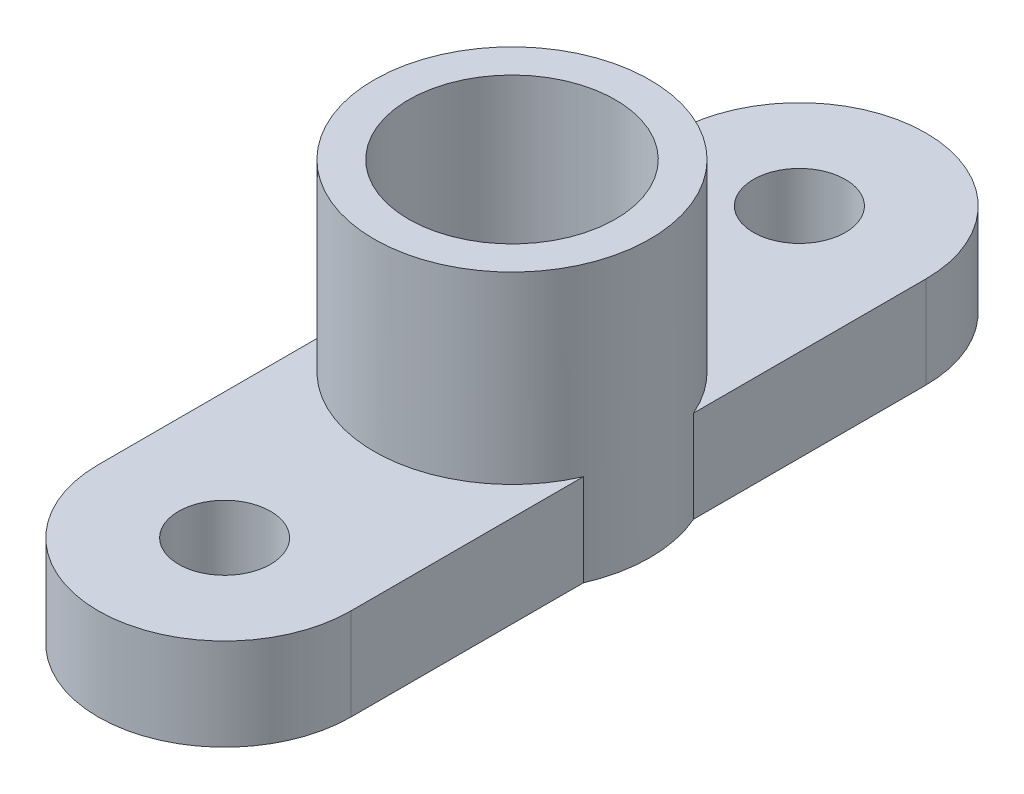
ISO-10303-21;
HEADER;
FILE_DESCRIPTION(('STEP AP214'),'2;1');
FILE_NAME('part.step','',(''),(''),'','','');
FILE_SCHEMA(('AUTOMOTIVE_DESIGN { 1 0 10303 214 1 1 1 1 }'));
ENDSEC;
DATA;
#1=APPLICATION_CONTEXT('core data for automotive mechanical design processes');
#2=APPLICATION_PROTOCOL_DEFINITION('international standard','automotive_design',2000,#1);
#3=PRODUCT_CONTEXT('',#1,'mechanical');
#4=PRODUCT('Part','Part','',(#3));
#5=PRODUCT_RELATED_PRODUCT_CATEGORY('part','',(#4));
#6=PRODUCT_DEFINITION_FORMATION('','',#4);
#7=PRODUCT_DEFINITION_CONTEXT('part definition',#1,'design');
#8=PRODUCT_DEFINITION('design','',#6,#7);
#9=PRODUCT_DEFINITION_SHAPE('','',#8);
#10=(LENGTH_UNIT() NAMED_UNIT(*) SI_UNIT(.MILLI.,.METRE.));
#11=(NAMED_UNIT(*) PLANE_ANGLE_UNIT() SI_UNIT($,.RADIAN.));
#12=(NAMED_UNIT(*) SI_UNIT($,.STERADIAN.) SOLID_ANGLE_UNIT());
#13=UNCERTAINTY_MEASURE_WITH_UNIT(LENGTH_MEASURE(1.E-05),#10,'distance_accuracy_value','');
#14=(GEOMETRIC_REPRESENTATION_CONTEXT(3) GLOBAL_UNCERTAINTY_ASSIGNED_CONTEXT((#13)) GLOBAL_UNIT_ASSIGNED_CONTEXT((#10,
#11,#12)) REPRESENTATION_CONTEXT('',''));
#15=CARTESIAN_POINT('',(0.,0.,0.));
#16=DIRECTION('',(0.,0.,1.));
#17=DIRECTION('',(1.,0.,0.));
#18=AXIS2_PLACEMENT_3D('',#15,#16,#17);
#19=CARTESIAN_POINT('',(-11.,-8.,-25.));
#20=DIRECTION('',(1.,0.,0.));
#21=DIRECTION('',(0.,0.,-1.));
#22=AXIS2_PLACEMENT_3D('',#19,#20,#21);
#23=PLANE('',#22);
#24=DIRECTION('',(0.,1.,0.));
#25=VECTOR('',#24,1.);
#26=CARTESIAN_POINT('',(-11.,-8.,-4.79583152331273));
#27=LINE('',#26,#25);
#28=CARTESIAN_POINT('',(-11.,0.,-4.79583152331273));
#29=VERTEX_POINT('',#28);
#30=CARTESIAN_POINT('',(-11.,-8.,-4.79583152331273));
#31=VERTEX_POINT('',#30);
#32=EDGE_CURVE('E488',#29,#31,#27,.F.);
#33=ORIENTED_EDGE('',*,*,#32,.F.);
#34=DIRECTION('',(0.,0.,-1.));
#35=VECTOR('',#34,1.);
#36=CARTESIAN_POINT('',(-11.,0.,-25.));
#37=LINE('',#36,#35);
#38=CARTESIAN_POINT('',(-11.,0.,-25.));
#39=VERTEX_POINT('',#38);
#40=EDGE_CURVE('E432',#29,#39,#37,.T.);
#41=ORIENTED_EDGE('',*,*,#40,.T.);
#42=DIRECTION('',(0.,1.,0.));
#43=VECTOR('',#42,1.);
#44=CARTESIAN_POINT('',(-11.,-8.,-25.));
#45=LINE('',#44,#43);
#46=CARTESIAN_POINT('',(-11.,-8.,-25.));
#47=VERTEX_POINT('',#46);
#48=EDGE_CURVE('E447',#47,#39,#45,.T.);
#49=ORIENTED_EDGE('',*,*,#48,.F.);
#50=DIRECTION('',(0.,0.,-1.));
#51=VECTOR('',#50,1.);
#52=CARTESIAN_POINT('',(-11.,-8.,-25.));
#53=LINE('',#52,#51);
#54=EDGE_CURVE('E364',#31,#47,#53,.T.);
#55=ORIENTED_EDGE('',*,*,#54,.F.);
#56=EDGE_LOOP('',(#33,#41,#49,#55));
#57=FACE_BOUND('',#56,.T.);
#58=ADVANCED_FACE('F349',(#57),#23,.F.);
#59=DIRECTION('',(0.,1.,0.));
#60=VECTOR('',#59,1.);
#61=CARTESIAN_POINT('',(-11.,-8.,4.79583152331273));
#62=LINE('',#61,#60);
#63=CARTESIAN_POINT('',(-11.,-8.,4.79583152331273));
#64=VERTEX_POINT('',#63);
#65=CARTESIAN_POINT('',(-11.,0.,4.79583152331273));
#66=VERTEX_POINT('',#65);
#67=EDGE_CURVE('E372',#64,#66,#62,.T.);
#68=ORIENTED_EDGE('',*,*,#67,.F.);
#69=CARTESIAN_POINT('',(-11.,-8.,25.));
#70=VERTEX_POINT('',#69);
#71=EDGE_CURVE('E459',#70,#64,#53,.T.);
#72=ORIENTED_EDGE('',*,*,#71,.F.);
#73=DIRECTION('',(0.,1.,0.));
#74=VECTOR('',#73,1.);
#75=CARTESIAN_POINT('',(-11.,-8.,25.));
#76=LINE('',#75,#74);
#77=CARTESIAN_POINT('',(-11.,0.,25.));
#78=VERTEX_POINT('',#77);
#79=EDGE_CURVE('E444',#70,#78,#76,.T.);
#80=ORIENTED_EDGE('',*,*,#79,.T.);
#81=EDGE_CURVE('E465',#78,#66,#37,.T.);
#82=ORIENTED_EDGE('',*,*,#81,.T.);
#83=EDGE_LOOP('',(#68,#72,#80,#82));
#84=FACE_BOUND('',#83,.T.);
#85=ADVANCED_FACE('F517',(#84),#23,.F.);
#86=CARTESIAN_POINT('',(11.,-8.,25.));
#87=DIRECTION('',(-1.,0.,0.));
#88=DIRECTION('',(0.,0.,1.));
#89=AXIS2_PLACEMENT_3D('',#86,#87,#88);
#90=PLANE('',#89);
#91=DIRECTION('',(0.,1.,0.));
#92=VECTOR('',#91,1.);
#93=CARTESIAN_POINT('',(11.,-8.,4.79583152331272));
#94=LINE('',#93,#92);
#95=CARTESIAN_POINT('',(11.,0.,4.79583152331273));
#96=VERTEX_POINT('',#95);
#97=CARTESIAN_POINT('',(11.,-8.,4.79583152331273));
#98=VERTEX_POINT('',#97);
#99=EDGE_CURVE('E11',#96,#98,#94,.F.);
#100=ORIENTED_EDGE('',*,*,#99,.F.);
#101=DIRECTION('',(0.,0.,1.));
#102=VECTOR('',#101,1.);
#103=CARTESIAN_POINT('',(11.,0.,25.));
#104=LINE('',#103,#102);
#105=CARTESIAN_POINT('',(11.,0.,25.));
#106=VERTEX_POINT('',#105);
#107=EDGE_CURVE('E425',#96,#106,#104,.T.);
#108=ORIENTED_EDGE('',*,*,#107,.T.);
#109=DIRECTION('',(0.,1.,0.));
#110=VECTOR('',#109,1.);
#111=CARTESIAN_POINT('',(11.,-8.,25.));
#112=LINE('',#111,#110);
#113=CARTESIAN_POINT('',(11.,-8.,25.));
#114=VERTEX_POINT('',#113);
#115=EDGE_CURVE('E451',#114,#106,#112,.T.);
#116=ORIENTED_EDGE('',*,*,#115,.F.);
#117=DIRECTION('',(0.,0.,1.));
#118=VECTOR('',#117,1.);
#119=CARTESIAN_POINT('',(11.,-8.,25.));
#120=LINE('',#119,#118);
#121=EDGE_CURVE('E456',#98,#114,#120,.T.);
#122=ORIENTED_EDGE('',*,*,#121,.F.);
#123=EDGE_LOOP('',(#100,#108,#116,#122));
#124=FACE_BOUND('',#123,.T.);
#125=ADVANCED_FACE('F522',(#124),#90,.F.);
#126=DIRECTION('',(0.,1.,0.));
#127=VECTOR('',#126,1.);
#128=CARTESIAN_POINT('',(11.,-8.,-4.79583152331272));
#129=LINE('',#128,#127);
#130=CARTESIAN_POINT('',(11.,-8.,-4.79583152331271));
#131=VERTEX_POINT('',#130);
#132=CARTESIAN_POINT('',(11.,0.,-4.79583152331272));
#133=VERTEX_POINT('',#132);
#134=EDGE_CURVE('E357',#131,#133,#129,.T.);
#135=ORIENTED_EDGE('',*,*,#134,.F.);
#136=CARTESIAN_POINT('',(11.,-8.,-25.));
#137=VERTEX_POINT('',#136);
#138=EDGE_CURVE('E454',#137,#131,#120,.T.);
#139=ORIENTED_EDGE('',*,*,#138,.F.);
#140=DIRECTION('',(0.,1.,0.));
#141=VECTOR('',#140,1.);
#142=CARTESIAN_POINT('',(11.,-8.,-25.));
#143=LINE('',#142,#141);
#144=CARTESIAN_POINT('',(11.,0.,-25.));
#145=VERTEX_POINT('',#144);
#146=EDGE_CURVE('E421',#137,#145,#143,.T.);
#147=ORIENTED_EDGE('',*,*,#146,.T.);
#148=EDGE_CURVE('E414',#145,#133,#104,.T.);
#149=ORIENTED_EDGE('',*,*,#148,.T.);
#150=EDGE_LOOP('',(#135,#139,#147,#149));
#151=FACE_BOUND('',#150,.T.);
#152=ADVANCED_FACE('F416',(#151),#90,.F.);
#153=CARTESIAN_POINT('',(0.,16.,0.));
#154=DIRECTION('',(0.,-1.,0.));
#155=DIRECTION('',(0.,0.,-1.));
#156=AXIS2_PLACEMENT_3D('',#153,#154,#155);
#157=CYLINDRICAL_SURFACE('',#156,12.);
#158=CARTESIAN_POINT('',(0.,16.,0.));
#159=DIRECTION('',(0.,1.,0.));
#160=DIRECTION('',(0.,0.,1.));
#161=AXIS2_PLACEMENT_3D('',#158,#159,#160);
#162=CIRCLE('',#161,12.);
#163=CARTESIAN_POINT('',(0.,16.,12.));
#164=VERTEX_POINT('',#163);
#165=EDGE_CURVE('E434',#164,#164,#162,.T.);
#166=ORIENTED_EDGE('',*,*,#165,.F.);
#167=EDGE_LOOP('',(#166));
#168=FACE_BOUND('',#167,.T.);
#169=CARTESIAN_POINT('',(0.,0.,0.));
#170=DIRECTION('',(0.,1.,0.));
#171=DIRECTION('',(0.,0.,1.));
#172=AXIS2_PLACEMENT_3D('',#169,#170,#171);
#173=CIRCLE('',#172,12.);
#174=EDGE_CURVE('E435',#66,#96,#173,.T.);
#175=ORIENTED_EDGE('',*,*,#174,.T.);
#176=ORIENTED_EDGE('',*,*,#99,.T.);
#177=CARTESIAN_POINT('',(0.,-8.,0.));
#178=DIRECTION('',(0.,-1.,0.));
#179=DIRECTION('',(0.,0.,-1.));
#180=AXIS2_PLACEMENT_3D('',#177,#178,#179);
#181=CIRCLE('',#180,12.);
#182=EDGE_CURVE('E440',#131,#98,#181,.T.);
#183=ORIENTED_EDGE('',*,*,#182,.F.);
#184=ORIENTED_EDGE('',*,*,#134,.T.);
#185=EDGE_CURVE('E429',#133,#29,#173,.T.);
#186=ORIENTED_EDGE('',*,*,#185,.T.);
#187=ORIENTED_EDGE('',*,*,#32,.T.);
#188=EDGE_CURVE('E491',#64,#31,#181,.T.);
#189=ORIENTED_EDGE('',*,*,#188,.F.);
#190=ORIENTED_EDGE('',*,*,#67,.T.);
#191=EDGE_LOOP('',(#175,#176,#183,#184,#186,#187,#189,#190));
#192=FACE_BOUND('',#191,.T.);
#193=ADVANCED_FACE('F351',(#168,#192),#157,.T.);
#194=CARTESIAN_POINT('',(0.,16.,0.));
#195=DIRECTION('',(0.,1.,0.));
#196=DIRECTION('',(0.,0.,1.));
#197=AXIS2_PLACEMENT_3D('',#194,#195,#196);
#198=PLANE('',#197);
#199=CARTESIAN_POINT('',(0.,16.,0.));
#200=DIRECTION('',(0.,1.,0.));
#201=DIRECTION('',(0.,0.,1.));
#202=AXIS2_PLACEMENT_3D('',#199,#200,#201);
#203=CIRCLE('',#202,9.);
#204=CARTESIAN_POINT('',(0.,16.,9.));
#205=VERTEX_POINT('',#204);
#206=EDGE_CURVE('E485',#205,#205,#203,.T.);
#207=ORIENTED_EDGE('',*,*,#206,.F.);
#208=EDGE_LOOP('',(#207));
#209=FACE_BOUND('',#208,.T.);
#210=ORIENTED_EDGE('',*,*,#165,.T.);
#211=EDGE_LOOP('',(#210));
#212=FACE_BOUND('',#211,.T.);
#213=ADVANCED_FACE('F523',(#209,#212),#198,.T.);
#214=CARTESIAN_POINT('',(0.,0.,25.));
#215=DIRECTION('',(0.,-1.,0.));
#216=DIRECTION('',(0.,0.,-1.));
#217=AXIS2_PLACEMENT_3D('',#214,#215,#216);
#218=PLANE('',#217);
#219=ORIENTED_EDGE('',*,*,#185,.F.);
#220=ORIENTED_EDGE('',*,*,#148,.F.);
#221=CARTESIAN_POINT('',(0.,0.,-25.));
#222=DIRECTION('',(0.,-1.,0.));
#223=DIRECTION('',(0.,0.,-1.));
#224=AXIS2_PLACEMENT_3D('',#221,#222,#223);
#225=CIRCLE('',#224,11.);
#226=EDGE_CURVE('E463',#39,#145,#225,.T.);
#227=ORIENTED_EDGE('',*,*,#226,.F.);
#228=ORIENTED_EDGE('',*,*,#40,.F.);
#229=EDGE_LOOP('',(#219,#220,#227,#228));
#230=FACE_BOUND('',#229,.T.);
#231=CARTESIAN_POINT('',(0.,0.,-25.));
#232=DIRECTION('',(0.,-1.,0.));
#233=DIRECTION('',(0.,0.,-1.));
#234=AXIS2_PLACEMENT_3D('',#231,#232,#233);
#235=CIRCLE('',#234,4.);
#236=CARTESIAN_POINT('',(0.,0.,-29.));
#237=VERTEX_POINT('',#236);
#238=EDGE_CURVE('E473',#237,#237,#235,.T.);
#239=ORIENTED_EDGE('',*,*,#238,.T.);
#240=EDGE_LOOP('',(#239));
#241=FACE_BOUND('',#240,.T.);
#242=ADVANCED_FACE('F430',(#230,#241),#218,.F.);
#243=CARTESIAN_POINT('',(0.,-8.,25.));
#244=DIRECTION('',(0.,-1.,0.));
#245=DIRECTION('',(0.,0.,-1.));
#246=AXIS2_PLACEMENT_3D('',#243,#244,#245);
#247=PLANE('',#246);
#248=ORIENTED_EDGE('',*,*,#182,.T.);
#249=ORIENTED_EDGE('',*,*,#121,.T.);
#250=CARTESIAN_POINT('',(0.,-8.,25.));
#251=DIRECTION('',(0.,-1.,0.));
#252=DIRECTION('',(0.,0.,-1.));
#253=AXIS2_PLACEMENT_3D('',#250,#251,#252);
#254=CIRCLE('',#253,11.);
#255=EDGE_CURVE('E424',#114,#70,#254,.T.);
#256=ORIENTED_EDGE('',*,*,#255,.T.);
#257=ORIENTED_EDGE('',*,*,#71,.T.);
#258=ORIENTED_EDGE('',*,*,#188,.T.);
#259=ORIENTED_EDGE('',*,*,#54,.T.);
#260=CARTESIAN_POINT('',(0.,-8.,-25.));
#261=DIRECTION('',(0.,-1.,0.));
#262=DIRECTION('',(0.,0.,-1.));
#263=AXIS2_PLACEMENT_3D('',#260,#261,#262);
#264=CIRCLE('',#263,11.);
#265=EDGE_CURVE('E457',#47,#137,#264,.T.);
#266=ORIENTED_EDGE('',*,*,#265,.T.);
#267=ORIENTED_EDGE('',*,*,#138,.T.);
#268=EDGE_LOOP('',(#248,#249,#256,#257,#258,#259,#266,#267));
#269=FACE_BOUND('',#268,.T.);
#270=CARTESIAN_POINT('',(0.,-8.,0.));
#271=DIRECTION('',(0.,1.,0.));
#272=DIRECTION('',(0.,0.,1.));
#273=AXIS2_PLACEMENT_3D('',#270,#271,#272);
#274=CIRCLE('',#273,9.);
#275=CARTESIAN_POINT('',(0.,-8.,9.));
#276=VERTEX_POINT('',#275);
#277=EDGE_CURVE('E482',#276,#276,#274,.T.);
#278=ORIENTED_EDGE('',*,*,#277,.T.);
#279=EDGE_LOOP('',(#278));
#280=FACE_BOUND('',#279,.T.);
#281=CARTESIAN_POINT('',(0.,-8.,-25.));
#282=DIRECTION('',(0.,-1.,0.));
#283=DIRECTION('',(0.,0.,-1.));
#284=AXIS2_PLACEMENT_3D('',#281,#282,#283);
#285=CIRCLE('',#284,4.);
#286=CARTESIAN_POINT('',(0.,-8.,-29.));
#287=VERTEX_POINT('',#286);
#288=EDGE_CURVE('E470',#287,#287,#285,.T.);
#289=ORIENTED_EDGE('',*,*,#288,.F.);
#290=EDGE_LOOP('',(#289));
#291=FACE_BOUND('',#290,.T.);
#292=CARTESIAN_POINT('',(0.,-8.,25.));
#293=DIRECTION('',(0.,-1.,0.));
#294=DIRECTION('',(0.,0.,-1.));
#295=AXIS2_PLACEMENT_3D('',#292,#293,#294);
#296=CIRCLE('',#295,4.);
#297=CARTESIAN_POINT('',(0.,-8.,21.));
#298=VERTEX_POINT('',#297);
#299=EDGE_CURVE('E476',#298,#298,#296,.T.);
#300=ORIENTED_EDGE('',*,*,#299,.F.);
#301=EDGE_LOOP('',(#300));
#302=FACE_BOUND('',#301,.T.);
#303=ADVANCED_FACE('F495',(#269,#280,#291,#302),#247,.T.);
#304=ORIENTED_EDGE('',*,*,#174,.F.);
#305=ORIENTED_EDGE('',*,*,#81,.F.);
#306=CARTESIAN_POINT('',(0.,0.,25.));
#307=DIRECTION('',(0.,-1.,0.));
#308=DIRECTION('',(0.,0.,-1.));
#309=AXIS2_PLACEMENT_3D('',#306,#307,#308);
#310=CIRCLE('',#309,11.);
#311=EDGE_CURVE('E467',#106,#78,#310,.T.);
#312=ORIENTED_EDGE('',*,*,#311,.F.);
#313=ORIENTED_EDGE('',*,*,#107,.F.);
#314=EDGE_LOOP('',(#304,#305,#312,#313));
#315=FACE_BOUND('',#314,.T.);
#316=CARTESIAN_POINT('',(0.,0.,25.));
#317=DIRECTION('',(0.,-1.,0.));
#318=DIRECTION('',(0.,0.,-1.));
#319=AXIS2_PLACEMENT_3D('',#316,#317,#318);
#320=CIRCLE('',#319,4.);
#321=CARTESIAN_POINT('',(0.,0.,21.));
#322=VERTEX_POINT('',#321);
#323=EDGE_CURVE('E479',#322,#322,#320,.T.);
#324=ORIENTED_EDGE('',*,*,#323,.T.);
#325=EDGE_LOOP('',(#324));
#326=FACE_BOUND('',#325,.T.);
#327=ADVANCED_FACE('F511',(#315,#326),#218,.F.);
#328=CARTESIAN_POINT('',(0.,-8.,25.));
#329=DIRECTION('',(0.,1.,0.));
#330=DIRECTION('',(0.,0.,1.));
#331=AXIS2_PLACEMENT_3D('',#328,#329,#330);
#332=CYLINDRICAL_SURFACE('',#331,11.);
#333=ORIENTED_EDGE('',*,*,#311,.T.);
#334=ORIENTED_EDGE('',*,*,#79,.F.);
#335=ORIENTED_EDGE('',*,*,#255,.F.);
#336=ORIENTED_EDGE('',*,*,#115,.T.);
#337=EDGE_LOOP('',(#333,#334,#335,#336));
#338=FACE_BOUND('',#337,.T.);
#339=ADVANCED_FACE('F502',(#338),#332,.T.);
#340=CARTESIAN_POINT('',(0.,-8.,-25.));
#341=DIRECTION('',(0.,1.,0.));
#342=DIRECTION('',(0.,0.,1.));
#343=AXIS2_PLACEMENT_3D('',#340,#341,#342);
#344=CYLINDRICAL_SURFACE('',#343,11.);
#345=ORIENTED_EDGE('',*,*,#226,.T.);
#346=ORIENTED_EDGE('',*,*,#146,.F.);
#347=ORIENTED_EDGE('',*,*,#265,.F.);
#348=ORIENTED_EDGE('',*,*,#48,.T.);
#349=EDGE_LOOP('',(#345,#346,#347,#348));
#350=FACE_BOUND('',#349,.T.);
#351=ADVANCED_FACE('F499',(#350),#344,.T.);
#352=CARTESIAN_POINT('',(0.,-8.,-25.));
#353=DIRECTION('',(0.,1.,0.));
#354=DIRECTION('',(0.,0.,1.));
#355=AXIS2_PLACEMENT_3D('',#352,#353,#354);
#356=CYLINDRICAL_SURFACE('',#355,4.);
#357=ORIENTED_EDGE('',*,*,#288,.T.);
#358=EDGE_LOOP('',(#357));
#359=FACE_BOUND('',#358,.T.);
#360=ORIENTED_EDGE('',*,*,#238,.F.);
#361=EDGE_LOOP('',(#360));
#362=FACE_BOUND('',#361,.T.);
#363=ADVANCED_FACE('F501',(#359,#362),#356,.F.);
#364=CARTESIAN_POINT('',(0.,-8.,25.));
#365=DIRECTION('',(0.,1.,0.));
#366=DIRECTION('',(0.,0.,1.));
#367=AXIS2_PLACEMENT_3D('',#364,#365,#366);
#368=CYLINDRICAL_SURFACE('',#367,4.);
#369=ORIENTED_EDGE('',*,*,#299,.T.);
#370=EDGE_LOOP('',(#369));
#371=FACE_BOUND('',#370,.T.);
#372=ORIENTED_EDGE('',*,*,#323,.F.);
#373=EDGE_LOOP('',(#372));
#374=FACE_BOUND('',#373,.T.);
#375=ADVANCED_FACE('F508',(#371,#374),#368,.F.);
#376=CARTESIAN_POINT('',(0.,-8.,0.));
#377=DIRECTION('',(0.,1.,0.));
#378=DIRECTION('',(0.,0.,1.));
#379=AXIS2_PLACEMENT_3D('',#376,#377,#378);
#380=CYLINDRICAL_SURFACE('',#379,9.);
#381=ORIENTED_EDGE('',*,*,#277,.F.);
#382=EDGE_LOOP('',(#381));
#383=FACE_BOUND('',#382,.T.);
#384=ORIENTED_EDGE('',*,*,#206,.T.);
#385=EDGE_LOOP('',(#384));
#386=FACE_BOUND('',#385,.T.);
#387=ADVANCED_FACE('F536',(#383,#386),#380,.F.);
#388=CLOSED_SHELL('',(#58,#85,#125,#152,#193,#213,#242,#303,#327,#339,#351,#363,#375,#387));
#389=MANIFOLD_SOLID_BREP('B2',#388);
#390=ADVANCED_BREP_SHAPE_REPRESENTATION('',(#18,#389),#14);
#391=SHAPE_DEFINITION_REPRESENTATION(#9,#390);
ENDSEC;
END-ISO-10303-21;
